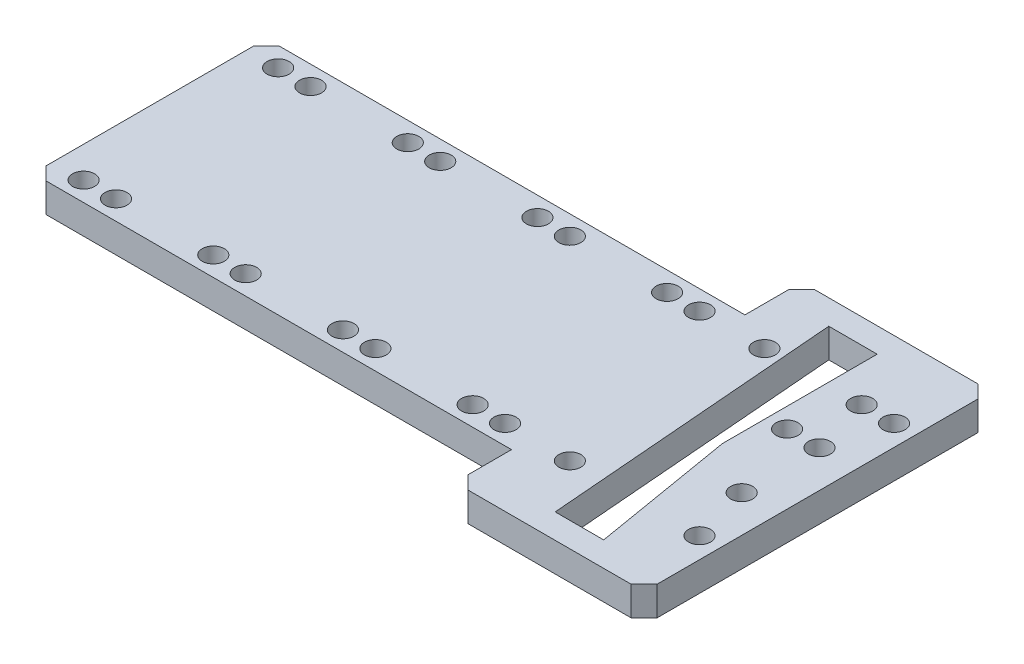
from build123d import *

# Parameters (mm, degrees)
SKETCH11_R          = 1.7
BOSS_EXTRUDE4_DEPTH = 4.5


with BuildPart() as part:
    # Sketch11 → Boss-Extrude4 (new body)
    with BuildSketch(Plane(origin=(0, 0, 0), x_dir=(1, 0, 0), z_dir=(0, 1, 0))):
        Polygon((-44, -18), (27.8, -18), (27.8, -24.75), (29.8, -26.75), (55, -26.75), (57, -24.75), (57, 24.75), (55, 26.75), (29.8, 26.75), (27.8, 24.75), (27.8, 18), (-44, 18), (-46, 16), (-46, -16), align=None)
        with Locations(Location((53.8, 15, 0), (0, 0, 270))):
            Circle(SKETCH11_R, mode=Mode.SUBTRACT)
        with Locations(Location((48.8, 15, 0), (0, 0, 270))):
            Circle(SKETCH11_R, mode=Mode.SUBTRACT)
        with Locations(Location((53.8, -15, 0), (0, 0, 90))):
            Circle(SKETCH11_R, mode=Mode.SUBTRACT)
        with Locations(Location((-41.2, 15, 0), (0, 0, 270))):
            Circle(SKETCH11_R, mode=Mode.SUBTRACT)
        with Locations(Location((-21.2, 15, 0), (0, 0, 270))):
            Circle(SKETCH11_R, mode=Mode.SUBTRACT)
        with Locations(Location((-16.2, 15, 0), (0, 0, 270))):
            Circle(SKETCH11_R, mode=Mode.SUBTRACT)
        with Locations(Location((33.8, -15, 0), (0, 0, 90))):
            Circle(SKETCH11_R, mode=Mode.SUBTRACT)
        with Locations(Location((-36.2, 15, 0), (0, 0, 270))):
            Circle(SKETCH11_R, mode=Mode.SUBTRACT)
        with Locations(Location((-1.2, 15, 0), (0, 0, 270))):
            Circle(SKETCH11_R, mode=Mode.SUBTRACT)
        with Locations(Location((3.8, 15, 0), (0, 0, 270))):
            Circle(SKETCH11_R, mode=Mode.SUBTRACT)
        with Locations(Location((23.8, -15, 0), (0, 0, 90))):
            Circle(SKETCH11_R, mode=Mode.SUBTRACT)
        with Locations(Location((18.8, 15, 0), (0, 0, 270))):
            Circle(SKETCH11_R, mode=Mode.SUBTRACT)
        with Locations(Location((23.8, 15, 0), (0, 0, 270))):
            Circle(SKETCH11_R, mode=Mode.SUBTRACT)
        with Locations(Location((18.8, -15, 0), (0, 0, 90))):
            Circle(SKETCH11_R, mode=Mode.SUBTRACT)
        with Locations(Location((3.8, -15, 0), (0, 0, 90))):
            Circle(SKETCH11_R, mode=Mode.SUBTRACT)
        with Locations(Location((-1.2, -15, 0), (0, 0, 90))):
            Circle(SKETCH11_R, mode=Mode.SUBTRACT)
        with Locations(Location((-36.2, -15, 0), (0, 0, 90))):
            Circle(SKETCH11_R, mode=Mode.SUBTRACT)
        with Locations(Location((-16.2, -15, 0), (0, 0, 90))):
            Circle(SKETCH11_R, mode=Mode.SUBTRACT)
        with Locations(Location((-21.2, -15, 0), (0, 0, 90))):
            Circle(SKETCH11_R, mode=Mode.SUBTRACT)
        with Locations(Location((-41.2, -15, 0), (0, 0, 90))):
            Circle(SKETCH11_R, mode=Mode.SUBTRACT)
        with Locations(Location((33.8, 15, 0), (0, 0, 270))):
            Circle(SKETCH11_R, mode=Mode.SUBTRACT)
        with Locations(Location((46.3, 6, 0), (0, 0, 270))):
            Circle(SKETCH11_R, mode=Mode.SUBTRACT)
        with Locations(Location((51.3, 6, 0), (0, 0, 270))):
            Circle(SKETCH11_R, mode=Mode.SUBTRACT)
        with Locations(Location((51.3, -6, 0), (0, 0, 270))):
            Circle(SKETCH11_R, mode=Mode.SUBTRACT)
        Polygon((43.25, -0.91213876), (46.964246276, -22.95), (39.484246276, -22.95), (35.78322444, 22.95), (43.25, 22.95), align=None, mode=Mode.SUBTRACT)
    extrude(amount=BOSS_EXTRUDE4_DEPTH)


solid = part.part
